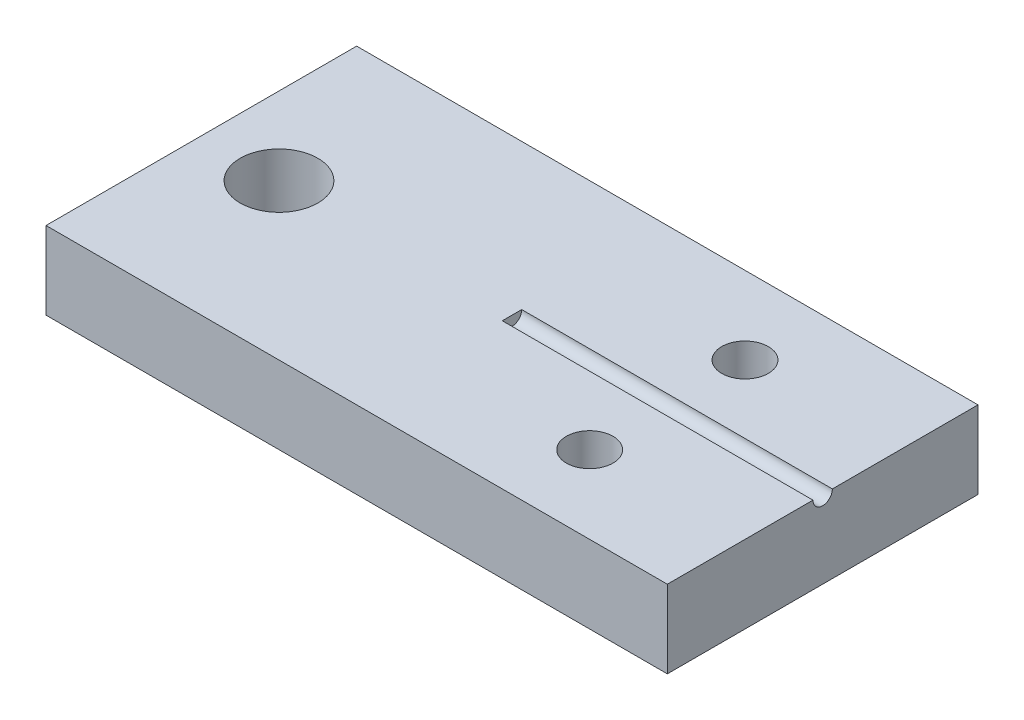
from build123d import *

# Parameters (mm, degrees)
SKETCH1_W           = 50.8
SKETCH1_H           = 25.4
SKETCH1_R           = 1.905
SKETCH1_R_2         = 3.175
BOSS_EXTRUDE1_DEPTH = 6.35
SKETCH2_R           = 0.79375
CUT_EXTRUDE1_DEPTH  = 25.4


with BuildPart() as part:
    # Sketch1 → Boss-Extrude1 (new body)
    with BuildSketch(Plane(origin=(0, 0, 0), x_dir=(1, 0, 0), z_dir=(0, 1, 0))):
        with Locations((25.4, 12.7)):
            Rectangle(SKETCH1_W, SKETCH1_H)
        with Locations(Location((38.1, 6.35, 0), (0, 0, 270))):
            Circle(SKETCH1_R, mode=Mode.SUBTRACT)
        with Locations(Location((38.1, 19.05, 0), (0, 0, 270))):
            Circle(SKETCH1_R, mode=Mode.SUBTRACT)
        with Locations(Location((6.35, 12.7, 0), (0, 0, 270))):
            Circle(SKETCH1_R_2, mode=Mode.SUBTRACT)
    extrude(amount=BOSS_EXTRUDE1_DEPTH)

    # Sketch2 → Cut-Extrude1 (cut)
    with BuildSketch(Plane(origin=(50.8, 0, 0), x_dir=(0, 0, -1), z_dir=(1, 0, 0))):
        with Locations((12.7, 6.35)):
            Circle(SKETCH2_R)
    extrude(amount=-CUT_EXTRUDE1_DEPTH, mode=Mode.SUBTRACT)


solid = part.part
